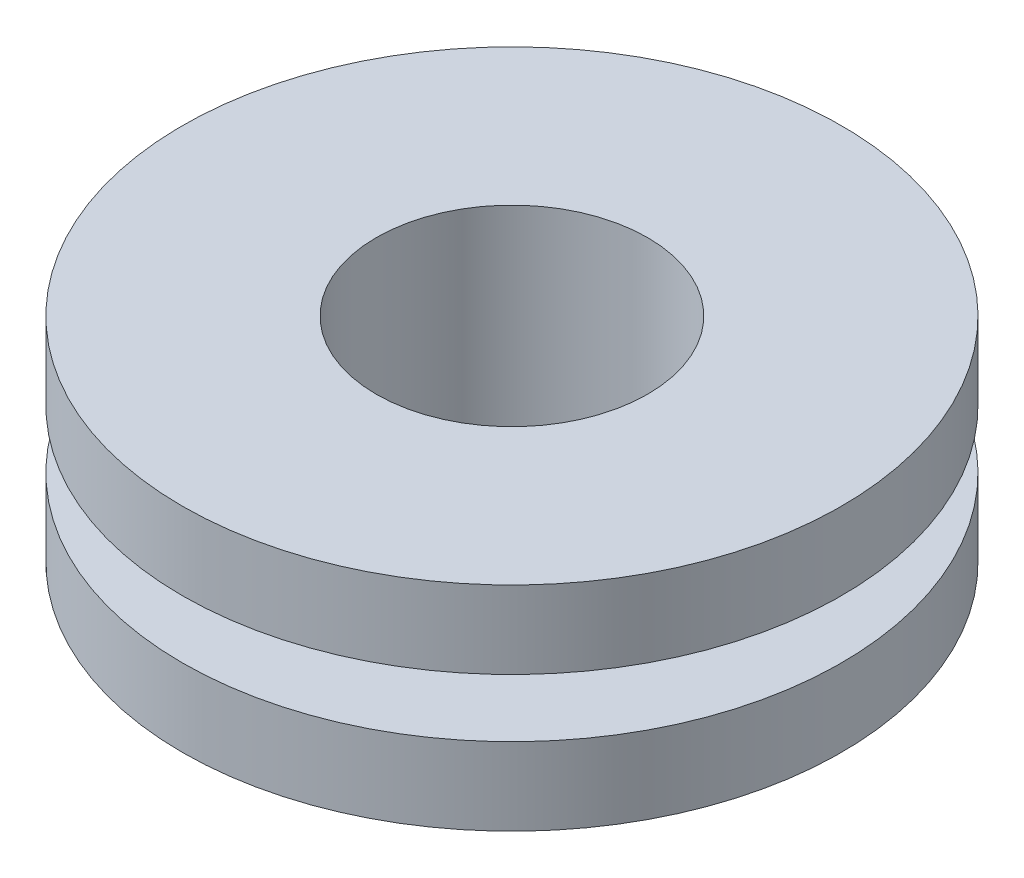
ISO-10303-21;
HEADER;
FILE_DESCRIPTION(('STEP AP214'),'2;1');
FILE_NAME('part.step','',(''),(''),'','','');
FILE_SCHEMA(('AUTOMOTIVE_DESIGN { 1 0 10303 214 1 1 1 1 }'));
ENDSEC;
DATA;
#1=APPLICATION_CONTEXT('core data for automotive mechanical design processes');
#2=APPLICATION_PROTOCOL_DEFINITION('international standard','automotive_design',2000,#1);
#3=PRODUCT_CONTEXT('',#1,'mechanical');
#4=PRODUCT('Part','Part','',(#3));
#5=PRODUCT_RELATED_PRODUCT_CATEGORY('part','',(#4));
#6=PRODUCT_DEFINITION_FORMATION('','',#4);
#7=PRODUCT_DEFINITION_CONTEXT('part definition',#1,'design');
#8=PRODUCT_DEFINITION('design','',#6,#7);
#9=PRODUCT_DEFINITION_SHAPE('','',#8);
#10=(LENGTH_UNIT() NAMED_UNIT(*) SI_UNIT(.MILLI.,.METRE.));
#11=(NAMED_UNIT(*) PLANE_ANGLE_UNIT() SI_UNIT($,.RADIAN.));
#12=(NAMED_UNIT(*) SI_UNIT($,.STERADIAN.) SOLID_ANGLE_UNIT());
#13=UNCERTAINTY_MEASURE_WITH_UNIT(LENGTH_MEASURE(1.E-05),#10,'distance_accuracy_value','');
#14=(GEOMETRIC_REPRESENTATION_CONTEXT(3) GLOBAL_UNCERTAINTY_ASSIGNED_CONTEXT((#13)) GLOBAL_UNIT_ASSIGNED_CONTEXT((#10,
#11,#12)) REPRESENTATION_CONTEXT('',''));
#15=CARTESIAN_POINT('',(0.,0.,0.));
#16=DIRECTION('',(0.,0.,1.));
#17=DIRECTION('',(1.,0.,0.));
#18=AXIS2_PLACEMENT_3D('',#15,#16,#17);
#19=CARTESIAN_POINT('',(0.,2.,0.));
#20=DIRECTION('',(0.,1.,0.));
#21=DIRECTION('',(0.,0.,1.));
#22=AXIS2_PLACEMENT_3D('',#19,#20,#21);
#23=PLANE('',#22);
#24=CARTESIAN_POINT('',(0.,2.,0.));
#25=DIRECTION('',(0.,1.,0.));
#26=DIRECTION('',(0.,0.,1.));
#27=AXIS2_PLACEMENT_3D('',#24,#25,#26);
#28=CIRCLE('',#27,8.5);
#29=CARTESIAN_POINT('',(0.,2.,8.5));
#30=VERTEX_POINT('',#29);
#31=EDGE_CURVE('E10',#30,#30,#28,.T.);
#32=ORIENTED_EDGE('',*,*,#31,.T.);
#33=EDGE_LOOP('',(#32));
#34=FACE_BOUND('',#33,.T.);
#35=CARTESIAN_POINT('',(0.,2.,0.));
#36=DIRECTION('',(0.,1.,0.));
#37=DIRECTION('',(0.,0.,1.));
#38=AXIS2_PLACEMENT_3D('',#35,#36,#37);
#39=CIRCLE('',#38,5.5);
#40=CARTESIAN_POINT('',(0.,2.,5.5));
#41=VERTEX_POINT('',#40);
#42=EDGE_CURVE('E42',#41,#41,#39,.T.);
#43=ORIENTED_EDGE('',*,*,#42,.F.);
#44=EDGE_LOOP('',(#43));
#45=FACE_BOUND('',#44,.T.);
#46=ADVANCED_FACE('F29',(#34,#45),#23,.T.);
#47=CARTESIAN_POINT('',(0.,2.,0.));
#48=DIRECTION('',(0.,-1.,0.));
#49=DIRECTION('',(0.,0.,-1.));
#50=AXIS2_PLACEMENT_3D('',#47,#48,#49);
#51=CYLINDRICAL_SURFACE('',#50,8.5);
#52=ORIENTED_EDGE('',*,*,#31,.F.);
#53=EDGE_LOOP('',(#52));
#54=FACE_BOUND('',#53,.T.);
#55=CARTESIAN_POINT('',(0.,0.,0.));
#56=DIRECTION('',(0.,1.,0.));
#57=DIRECTION('',(0.,0.,1.));
#58=AXIS2_PLACEMENT_3D('',#55,#56,#57);
#59=CIRCLE('',#58,8.5);
#60=CARTESIAN_POINT('',(0.,0.,8.5));
#61=VERTEX_POINT('',#60);
#62=EDGE_CURVE('E33',#61,#61,#59,.T.);
#63=ORIENTED_EDGE('',*,*,#62,.T.);
#64=EDGE_LOOP('',(#63));
#65=FACE_BOUND('',#64,.T.);
#66=ADVANCED_FACE('F31',(#54,#65),#51,.T.);
#67=CARTESIAN_POINT('',(0.,0.,0.));
#68=DIRECTION('',(0.,1.,0.));
#69=DIRECTION('',(0.,0.,1.));
#70=AXIS2_PLACEMENT_3D('',#67,#68,#69);
#71=PLANE('',#70);
#72=CARTESIAN_POINT('',(0.,0.,0.));
#73=DIRECTION('',(0.,1.,0.));
#74=DIRECTION('',(0.,0.,1.));
#75=AXIS2_PLACEMENT_3D('',#72,#73,#74);
#76=CIRCLE('',#75,3.5);
#77=CARTESIAN_POINT('',(0.,0.,3.5));
#78=VERTEX_POINT('',#77);
#79=EDGE_CURVE('E51',#78,#78,#76,.F.);
#80=ORIENTED_EDGE('',*,*,#79,.F.);
#81=EDGE_LOOP('',(#80));
#82=FACE_BOUND('',#81,.T.);
#83=ORIENTED_EDGE('',*,*,#62,.F.);
#84=EDGE_LOOP('',(#83));
#85=FACE_BOUND('',#84,.T.);
#86=ADVANCED_FACE('F83',(#82,#85),#71,.F.);
#87=CARTESIAN_POINT('',(0.,3.5,0.));
#88=DIRECTION('',(0.,-1.,0.));
#89=DIRECTION('',(0.,0.,-1.));
#90=AXIS2_PLACEMENT_3D('',#87,#88,#89);
#91=CYLINDRICAL_SURFACE('',#90,5.5);
#92=CARTESIAN_POINT('',(0.,3.5,0.));
#93=DIRECTION('',(0.,1.,0.));
#94=DIRECTION('',(0.,0.,1.));
#95=AXIS2_PLACEMENT_3D('',#92,#93,#94);
#96=CIRCLE('',#95,5.5);
#97=CARTESIAN_POINT('',(0.,3.5,5.5));
#98=VERTEX_POINT('',#97);
#99=EDGE_CURVE('E40',#98,#98,#96,.T.);
#100=ORIENTED_EDGE('',*,*,#99,.F.);
#101=EDGE_LOOP('',(#100));
#102=FACE_BOUND('',#101,.T.);
#103=ORIENTED_EDGE('',*,*,#42,.T.);
#104=EDGE_LOOP('',(#103));
#105=FACE_BOUND('',#104,.T.);
#106=ADVANCED_FACE('F77',(#102,#105),#91,.T.);
#107=CARTESIAN_POINT('',(0.,3.5,0.));
#108=DIRECTION('',(0.,1.,0.));
#109=DIRECTION('',(0.,0.,1.));
#110=AXIS2_PLACEMENT_3D('',#107,#108,#109);
#111=PLANE('',#110);
#112=CARTESIAN_POINT('',(0.,3.5,0.));
#113=DIRECTION('',(0.,1.,0.));
#114=DIRECTION('',(0.,0.,1.));
#115=AXIS2_PLACEMENT_3D('',#112,#113,#114);
#116=CIRCLE('',#115,8.5);
#117=CARTESIAN_POINT('',(0.,3.5,8.5));
#118=VERTEX_POINT('',#117);
#119=EDGE_CURVE('E48',#118,#118,#116,.T.);
#120=ORIENTED_EDGE('',*,*,#119,.F.);
#121=EDGE_LOOP('',(#120));
#122=FACE_BOUND('',#121,.T.);
#123=ORIENTED_EDGE('',*,*,#99,.T.);
#124=EDGE_LOOP('',(#123));
#125=FACE_BOUND('',#124,.T.);
#126=ADVANCED_FACE('F71',(#122,#125),#111,.F.);
#127=CARTESIAN_POINT('',(0.,5.5,0.));
#128=DIRECTION('',(0.,-1.,0.));
#129=DIRECTION('',(0.,0.,-1.));
#130=AXIS2_PLACEMENT_3D('',#127,#128,#129);
#131=CYLINDRICAL_SURFACE('',#130,8.5);
#132=CARTESIAN_POINT('',(0.,5.5,0.));
#133=DIRECTION('',(0.,1.,0.));
#134=DIRECTION('',(0.,0.,1.));
#135=AXIS2_PLACEMENT_3D('',#132,#133,#134);
#136=CIRCLE('',#135,8.5);
#137=CARTESIAN_POINT('',(0.,5.5,8.5));
#138=VERTEX_POINT('',#137);
#139=EDGE_CURVE('E45',#138,#138,#136,.T.);
#140=ORIENTED_EDGE('',*,*,#139,.F.);
#141=EDGE_LOOP('',(#140));
#142=FACE_BOUND('',#141,.T.);
#143=ORIENTED_EDGE('',*,*,#119,.T.);
#144=EDGE_LOOP('',(#143));
#145=FACE_BOUND('',#144,.T.);
#146=ADVANCED_FACE('F65',(#142,#145),#131,.T.);
#147=CARTESIAN_POINT('',(0.,5.5,0.));
#148=DIRECTION('',(0.,1.,0.));
#149=DIRECTION('',(0.,0.,1.));
#150=AXIS2_PLACEMENT_3D('',#147,#148,#149);
#151=PLANE('',#150);
#152=CARTESIAN_POINT('',(0.,5.5,0.));
#153=DIRECTION('',(0.,1.,0.));
#154=DIRECTION('',(0.,0.,1.));
#155=AXIS2_PLACEMENT_3D('',#152,#153,#154);
#156=CIRCLE('',#155,3.5);
#157=CARTESIAN_POINT('',(0.,5.5,3.5));
#158=VERTEX_POINT('',#157);
#159=EDGE_CURVE('E56',#158,#158,#156,.T.);
#160=ORIENTED_EDGE('',*,*,#159,.F.);
#161=EDGE_LOOP('',(#160));
#162=FACE_BOUND('',#161,.T.);
#163=ORIENTED_EDGE('',*,*,#139,.T.);
#164=EDGE_LOOP('',(#163));
#165=FACE_BOUND('',#164,.T.);
#166=ADVANCED_FACE('F62',(#162,#165),#151,.T.);
#167=CARTESIAN_POINT('',(0.,-9.89949493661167,0.));
#168=DIRECTION('',(0.,1.,0.));
#169=DIRECTION('',(0.,0.,1.));
#170=AXIS2_PLACEMENT_3D('',#167,#168,#169);
#171=CYLINDRICAL_SURFACE('',#170,3.5);
#172=ORIENTED_EDGE('',*,*,#79,.T.);
#173=EDGE_LOOP('',(#172));
#174=FACE_BOUND('',#173,.T.);
#175=ORIENTED_EDGE('',*,*,#159,.T.);
#176=EDGE_LOOP('',(#175));
#177=FACE_BOUND('',#176,.T.);
#178=ADVANCED_FACE('F60',(#174,#177),#171,.F.);
#179=CLOSED_SHELL('',(#46,#66,#86,#106,#126,#146,#166,#178));
#180=MANIFOLD_SOLID_BREP('B2',#179);
#181=ADVANCED_BREP_SHAPE_REPRESENTATION('',(#18,#180),#14);
#182=SHAPE_DEFINITION_REPRESENTATION(#9,#181);
ENDSEC;
END-ISO-10303-21;
